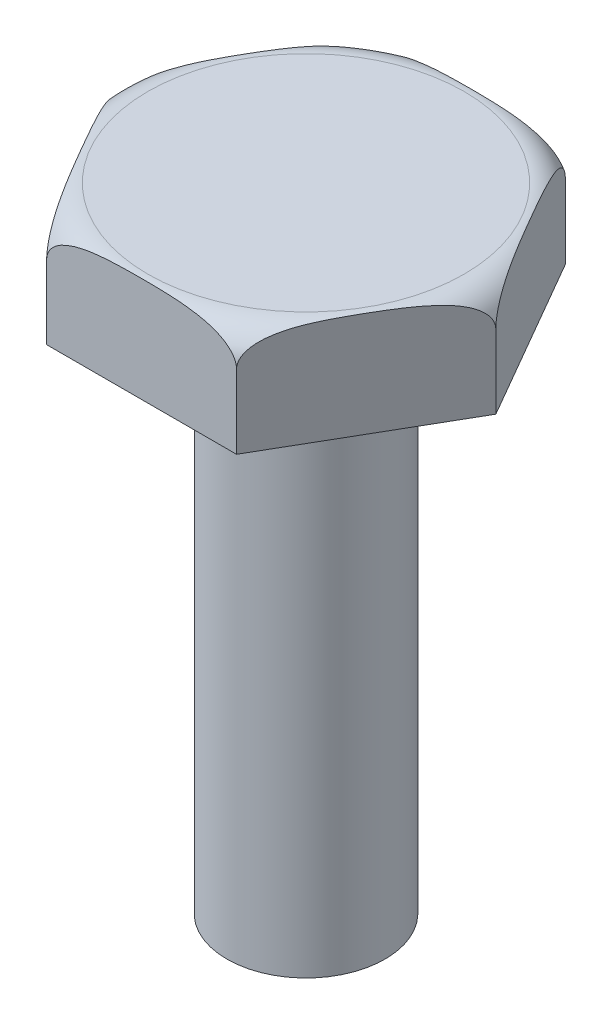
from build123d import *

# Parameters (mm, degrees)
SKETCH1_R      = 7.5
EXTRUDE1_DEPTH = 50
EXTRUDE2_DEPTH = 10


with BuildPart() as part:
    # Sketch1 → Extrude1 (new body)
    with BuildSketch(Plane(origin=(0, 0, 0), x_dir=(1, 0, 0), z_dir=(0, 1, 0))):
        with Locations(Location((0, 0, 0), (0, 0, 270))):
            Circle(SKETCH1_R)
    extrude(amount=EXTRUDE1_DEPTH)

    # Sketch2 → Extrude2 (add)
    with BuildSketch(Plane(origin=(0, 50, 0), x_dir=(1, 0, 0), z_dir=(0, 1, 0))):
        Polygon((18, 0), (9, 15.588457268), (-9, 15.588457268), (-18, 0), (-9, -15.588457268), (9, -15.588457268), align=None)
    extrude(amount=EXTRUDE2_DEPTH)

    # Sketch3 → Cut-Revolve1 (revolve, cut)
    with BuildSketch(Plane.XY, mode=Mode.PRIVATE) as cut_revolve1_sk:
        with BuildLine():
            Line((15, 60), (18, 60))
            Line((18, 60), (18, 57))
            ThreePointArc((18, 57), (17.121320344, 59.121320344), (15, 60))
        make_face()
    revolve(cut_revolve1_sk.sketch.rotate(Axis((0, 0, 0), (0, 1, 0)), 90), axis=Axis((0, 0, 0), (0, 1, 0)), mode=Mode.SUBTRACT)


solid = part.part
